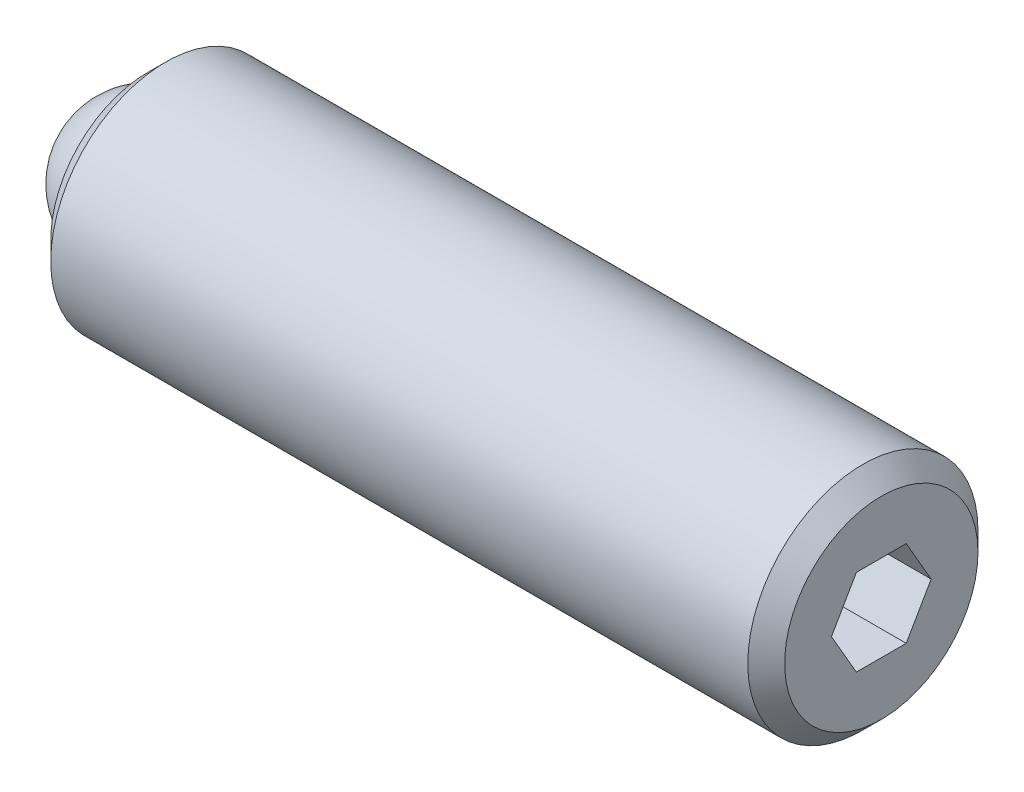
from build123d import *

# Parameters (mm, degrees)
SKETCH2_R           = 3.175
BOSS_EXTRUDE1_DEPTH = 20.240625
CHAMFER1_SIZE       = 0.508
CHAMFER2_SIZE       = 0.508
CUT_EXTRUDE2_DEPTH  = 2.286
SKETCH3_R           = 1.9812
CUT_EXTRUDE3_DEPTH  = 1.984375


with BuildPart() as part:
    # Sketch2 → Boss-Extrude1 (new body)
    with BuildSketch(Plane(origin=(0, 0, 0), x_dir=(0, 0, -1), z_dir=(1, 0, 0))):
        Circle(SKETCH2_R)
    extrude(amount=BOSS_EXTRUDE1_DEPTH)

    # Chamfer1
    chamfer1_edges = [part.edges().sort_by_distance(p)[0] for p in [
        (0, 0, 3.175),
    ]]
    chamfer(chamfer1_edges, length=CHAMFER1_SIZE)

    # Chamfer2
    chamfer2_edges = [part.edges().sort_by_distance(p)[0] for p in [
        (20.240625, 0, 3.175),
    ]]
    chamfer(chamfer2_edges, length=CHAMFER2_SIZE)

    # Sketch4 → Cut-Extrude2 (cut)
    with BuildSketch(Plane(origin=(20.240625, 0, 0), x_dir=(0, 0, -1), z_dir=(1, 0, 0))):
        Polygon((1.374815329, 0), (0.687407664, 1.190625), (-0.687407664, 1.190625), (-1.374815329, 0), (-0.687407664, -1.190625), (0.687407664, -1.190625), align=None)
    extrude(amount=-CUT_EXTRUDE2_DEPTH, mode=Mode.SUBTRACT)

    # Sketch3 → Cut-Extrude3 (cut)
    with BuildSketch(Plane.ZY):
        Circle(SKETCH3_R)
    extrude(amount=-CUT_EXTRUDE3_DEPTH, mode=Mode.SUBTRACT)


with BuildPart() as body_2:
    # Sketch5 → Revolve1 (revolve)
    with BuildSketch(Plane.ZY):
        with BuildLine():
            Line((0, 0), (0, -1.984375))
            ThreePointArc((0, -1.984375), (-1.984375, 0), (0, 1.984375))
            Line((0, 1.984375), (0, 0))
        make_face()
    revolve(axis=Axis((0, 0, 0), (0, 1, 0)))


solid = Compound([part.part, body_2.part])
